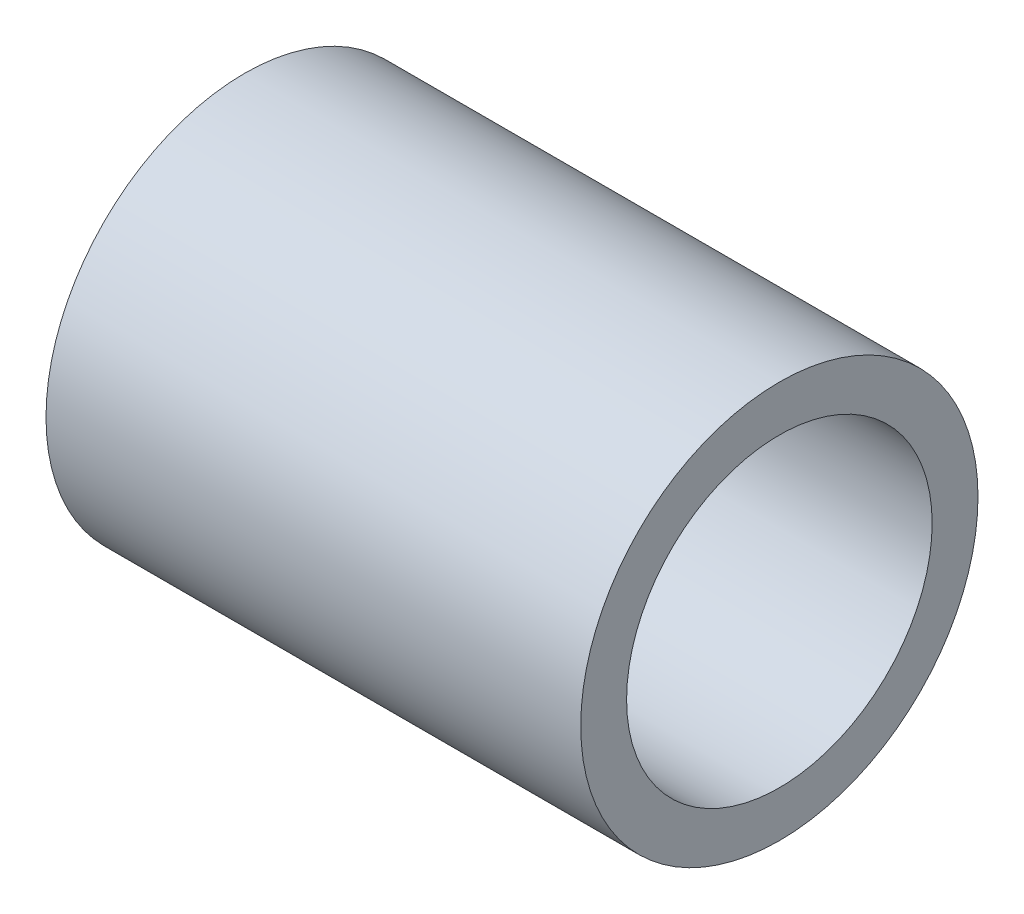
ISO-10303-21;
HEADER;
FILE_DESCRIPTION(('STEP AP214'),'2;1');
FILE_NAME('part.step','',(''),(''),'','','');
FILE_SCHEMA(('AUTOMOTIVE_DESIGN { 1 0 10303 214 1 1 1 1 }'));
ENDSEC;
DATA;
#1=APPLICATION_CONTEXT('core data for automotive mechanical design processes');
#2=APPLICATION_PROTOCOL_DEFINITION('international standard','automotive_design',2000,#1);
#3=PRODUCT_CONTEXT('',#1,'mechanical');
#4=PRODUCT('Part','Part','',(#3));
#5=PRODUCT_RELATED_PRODUCT_CATEGORY('part','',(#4));
#6=PRODUCT_DEFINITION_FORMATION('','',#4);
#7=PRODUCT_DEFINITION_CONTEXT('part definition',#1,'design');
#8=PRODUCT_DEFINITION('design','',#6,#7);
#9=PRODUCT_DEFINITION_SHAPE('','',#8);
#10=(LENGTH_UNIT() NAMED_UNIT(*) SI_UNIT(.MILLI.,.METRE.));
#11=(NAMED_UNIT(*) PLANE_ANGLE_UNIT() SI_UNIT($,.RADIAN.));
#12=(NAMED_UNIT(*) SI_UNIT($,.STERADIAN.) SOLID_ANGLE_UNIT());
#13=UNCERTAINTY_MEASURE_WITH_UNIT(LENGTH_MEASURE(1.E-05),#10,'distance_accuracy_value','');
#14=(GEOMETRIC_REPRESENTATION_CONTEXT(3) GLOBAL_UNCERTAINTY_ASSIGNED_CONTEXT((#13)) GLOBAL_UNIT_ASSIGNED_CONTEXT((#10,
#11,#12)) REPRESENTATION_CONTEXT('',''));
#15=CARTESIAN_POINT('',(0.,0.,0.));
#16=DIRECTION('',(0.,0.,1.));
#17=DIRECTION('',(1.,0.,0.));
#18=AXIS2_PLACEMENT_3D('',#15,#16,#17);
#19=CARTESIAN_POINT('',(44.45,0.,0.));
#20=DIRECTION('',(-1.,0.,0.));
#21=DIRECTION('',(0.,0.,1.));
#22=AXIS2_PLACEMENT_3D('',#19,#20,#21);
#23=CYLINDRICAL_SURFACE('',#22,12.7);
#24=CARTESIAN_POINT('',(44.45,0.,0.));
#25=DIRECTION('',(1.,0.,0.));
#26=DIRECTION('',(0.,0.,-1.));
#27=AXIS2_PLACEMENT_3D('',#24,#25,#26);
#28=CIRCLE('',#27,12.7);
#29=CARTESIAN_POINT('',(44.45,0.,-12.7));
#30=VERTEX_POINT('',#29);
#31=EDGE_CURVE('E43',#30,#30,#28,.T.);
#32=ORIENTED_EDGE('',*,*,#31,.T.);
#33=EDGE_LOOP('',(#32));
#34=FACE_BOUND('',#33,.T.);
#35=CARTESIAN_POINT('',(0.,0.,0.));
#36=DIRECTION('',(1.,0.,0.));
#37=DIRECTION('',(0.,0.,-1.));
#38=AXIS2_PLACEMENT_3D('',#35,#36,#37);
#39=CIRCLE('',#38,12.7);
#40=CARTESIAN_POINT('',(0.,0.,-12.7));
#41=VERTEX_POINT('',#40);
#42=EDGE_CURVE('E49',#41,#41,#39,.T.);
#43=ORIENTED_EDGE('',*,*,#42,.F.);
#44=EDGE_LOOP('',(#43));
#45=FACE_BOUND('',#44,.T.);
#46=ADVANCED_FACE('F36',(#34,#45),#23,.F.);
#47=CARTESIAN_POINT('',(44.45,0.,0.));
#48=DIRECTION('',(-1.,0.,0.));
#49=DIRECTION('',(0.,0.,1.));
#50=AXIS2_PLACEMENT_3D('',#47,#48,#49);
#51=CYLINDRICAL_SURFACE('',#50,16.51);
#52=CARTESIAN_POINT('',(44.45,0.,0.));
#53=DIRECTION('',(1.,0.,0.));
#54=DIRECTION('',(0.,0.,-1.));
#55=AXIS2_PLACEMENT_3D('',#52,#53,#54);
#56=CIRCLE('',#55,16.51);
#57=CARTESIAN_POINT('',(44.45,0.,-16.51));
#58=VERTEX_POINT('',#57);
#59=EDGE_CURVE('E10',#58,#58,#56,.T.);
#60=ORIENTED_EDGE('',*,*,#59,.F.);
#61=EDGE_LOOP('',(#60));
#62=FACE_BOUND('',#61,.T.);
#63=CARTESIAN_POINT('',(0.,0.,0.));
#64=DIRECTION('',(1.,0.,0.));
#65=DIRECTION('',(0.,0.,-1.));
#66=AXIS2_PLACEMENT_3D('',#63,#64,#65);
#67=CIRCLE('',#66,16.51);
#68=CARTESIAN_POINT('',(0.,0.,-16.51));
#69=VERTEX_POINT('',#68);
#70=EDGE_CURVE('E39',#69,#69,#67,.T.);
#71=ORIENTED_EDGE('',*,*,#70,.T.);
#72=EDGE_LOOP('',(#71));
#73=FACE_BOUND('',#72,.T.);
#74=ADVANCED_FACE('F56',(#62,#73),#51,.T.);
#75=CARTESIAN_POINT('',(44.45,0.,0.));
#76=DIRECTION('',(1.,0.,0.));
#77=DIRECTION('',(0.,0.,-1.));
#78=AXIS2_PLACEMENT_3D('',#75,#76,#77);
#79=PLANE('',#78);
#80=ORIENTED_EDGE('',*,*,#31,.F.);
#81=EDGE_LOOP('',(#80));
#82=FACE_BOUND('',#81,.T.);
#83=ORIENTED_EDGE('',*,*,#59,.T.);
#84=EDGE_LOOP('',(#83));
#85=FACE_BOUND('',#84,.T.);
#86=ADVANCED_FACE('F60',(#82,#85),#79,.T.);
#87=CARTESIAN_POINT('',(0.,0.,0.));
#88=DIRECTION('',(1.,0.,0.));
#89=DIRECTION('',(0.,0.,-1.));
#90=AXIS2_PLACEMENT_3D('',#87,#88,#89);
#91=PLANE('',#90);
#92=ORIENTED_EDGE('',*,*,#42,.T.);
#93=EDGE_LOOP('',(#92));
#94=FACE_BOUND('',#93,.T.);
#95=ORIENTED_EDGE('',*,*,#70,.F.);
#96=EDGE_LOOP('',(#95));
#97=FACE_BOUND('',#96,.T.);
#98=ADVANCED_FACE('F58',(#94,#97),#91,.F.);
#99=CLOSED_SHELL('',(#46,#74,#86,#98));
#100=MANIFOLD_SOLID_BREP('B2',#99);
#101=ADVANCED_BREP_SHAPE_REPRESENTATION('',(#18,#100),#14);
#102=SHAPE_DEFINITION_REPRESENTATION(#9,#101);
ENDSEC;
END-ISO-10303-21;
